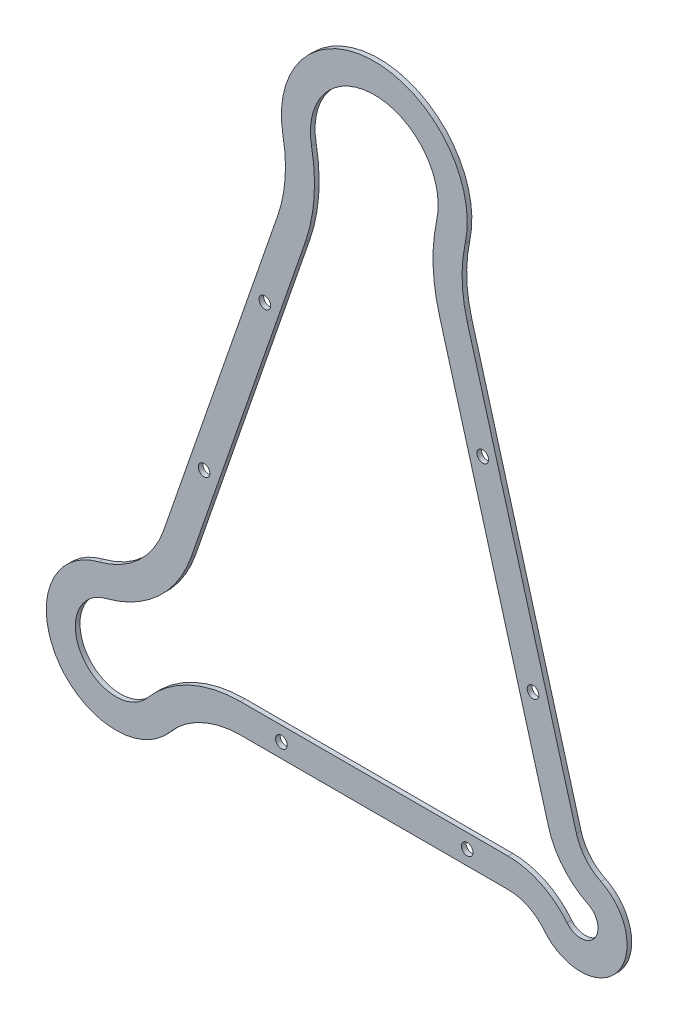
ISO-10303-21;
HEADER;
FILE_DESCRIPTION(('STEP AP214'),'2;1');
FILE_NAME('part.step','',(''),(''),'','','');
FILE_SCHEMA(('AUTOMOTIVE_DESIGN { 1 0 10303 214 1 1 1 1 }'));
ENDSEC;
DATA;
#1=APPLICATION_CONTEXT('core data for automotive mechanical design processes');
#2=APPLICATION_PROTOCOL_DEFINITION('international standard','automotive_design',2000,#1);
#3=PRODUCT_CONTEXT('',#1,'mechanical');
#4=PRODUCT('Part','Part','',(#3));
#5=PRODUCT_RELATED_PRODUCT_CATEGORY('part','',(#4));
#6=PRODUCT_DEFINITION_FORMATION('','',#4);
#7=PRODUCT_DEFINITION_CONTEXT('part definition',#1,'design');
#8=PRODUCT_DEFINITION('design','',#6,#7);
#9=PRODUCT_DEFINITION_SHAPE('','',#8);
#10=(LENGTH_UNIT() NAMED_UNIT(*) SI_UNIT(.MILLI.,.METRE.));
#11=(NAMED_UNIT(*) PLANE_ANGLE_UNIT() SI_UNIT($,.RADIAN.));
#12=(NAMED_UNIT(*) SI_UNIT($,.STERADIAN.) SOLID_ANGLE_UNIT());
#13=UNCERTAINTY_MEASURE_WITH_UNIT(LENGTH_MEASURE(1.E-05),#10,'distance_accuracy_value','');
#14=(GEOMETRIC_REPRESENTATION_CONTEXT(3) GLOBAL_UNCERTAINTY_ASSIGNED_CONTEXT((#13)) GLOBAL_UNIT_ASSIGNED_CONTEXT((#10,
#11,#12)) REPRESENTATION_CONTEXT('',''));
#15=CARTESIAN_POINT('',(0.,0.,0.));
#16=DIRECTION('',(0.,0.,1.));
#17=DIRECTION('',(1.,0.,0.));
#18=AXIS2_PLACEMENT_3D('',#15,#16,#17);
#19=CARTESIAN_POINT('',(73.1240495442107,-133.363811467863,2.54));
#20=DIRECTION('',(0.,0.,-1.));
#21=DIRECTION('',(-1.,0.,0.));
#22=AXIS2_PLACEMENT_3D('',#19,#20,#21);
#23=CYLINDRICAL_SURFACE('',#22,25.4);
#24=CARTESIAN_POINT('',(73.1240495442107,-133.363811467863,0.));
#25=DIRECTION('',(0.,0.,1.));
#26=DIRECTION('',(1.,0.,0.));
#27=AXIS2_PLACEMENT_3D('',#24,#25,#26);
#28=CIRCLE('',#27,25.4);
#29=CARTESIAN_POINT('',(73.1240495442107,-107.963811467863,0.));
#30=VERTEX_POINT('',#29);
#31=CARTESIAN_POINT('',(92.9519181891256,-117.488811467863,0.));
#32=VERTEX_POINT('',#31);
#33=EDGE_CURVE('E251',#30,#32,#28,.F.);
#34=ORIENTED_EDGE('',*,*,#33,.T.);
#35=DIRECTION('',(0.,0.,-1.));
#36=VECTOR('',#35,1.);
#37=CARTESIAN_POINT('',(92.9519181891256,-117.488811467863,2.54));
#38=LINE('',#37,#36);
#39=CARTESIAN_POINT('',(92.9519181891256,-117.488811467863,2.54));
#40=VERTEX_POINT('',#39);
#41=EDGE_CURVE('E11',#40,#32,#38,.T.);
#42=ORIENTED_EDGE('',*,*,#41,.F.);
#43=CARTESIAN_POINT('',(73.1240495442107,-133.363811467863,2.54));
#44=DIRECTION('',(0.,0.,1.));
#45=DIRECTION('',(1.,0.,0.));
#46=AXIS2_PLACEMENT_3D('',#43,#44,#45);
#47=CIRCLE('',#46,25.4);
#48=CARTESIAN_POINT('',(73.1240495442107,-107.963811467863,2.54));
#49=VERTEX_POINT('',#48);
#50=EDGE_CURVE('E327',#49,#40,#47,.F.);
#51=ORIENTED_EDGE('',*,*,#50,.F.);
#52=DIRECTION('',(0.,0.,-1.));
#53=VECTOR('',#52,1.);
#54=CARTESIAN_POINT('',(73.1240495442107,-107.963811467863,2.54));
#55=LINE('',#54,#53);
#56=EDGE_CURVE('E206',#49,#30,#55,.T.);
#57=ORIENTED_EDGE('',*,*,#56,.T.);
#58=EDGE_LOOP('',(#34,#42,#51,#57));
#59=FACE_BOUND('',#58,.T.);
#60=ADVANCED_FACE('F33',(#59),#23,.F.);
#61=CARTESIAN_POINT('',(112.77978683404,-101.613811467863,2.54));
#62=DIRECTION('',(0.,0.,-1.));
#63=DIRECTION('',(-1.,0.,0.));
#64=AXIS2_PLACEMENT_3D('',#61,#62,#63);
#65=CYLINDRICAL_SURFACE('',#64,25.4);
#66=CARTESIAN_POINT('',(112.77978683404,-101.613811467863,0.));
#67=DIRECTION('',(0.,0.,1.));
#68=DIRECTION('',(1.,0.,0.));
#69=AXIS2_PLACEMENT_3D('',#66,#67,#68);
#70=CIRCLE('',#69,25.4);
#71=CARTESIAN_POINT('',(123.873001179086,-78.7642907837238,0.));
#72=VERTEX_POINT('',#71);
#73=EDGE_CURVE('E254',#32,#72,#70,.T.);
#74=ORIENTED_EDGE('',*,*,#73,.T.);
#75=DIRECTION('',(0.,0.,-1.));
#76=VECTOR('',#75,1.);
#77=CARTESIAN_POINT('',(123.873001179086,-78.7642907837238,2.54));
#78=LINE('',#77,#76);
#79=CARTESIAN_POINT('',(123.873001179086,-78.7642907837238,2.54));
#80=VERTEX_POINT('',#79);
#81=EDGE_CURVE('E42',#80,#72,#78,.T.);
#82=ORIENTED_EDGE('',*,*,#81,.F.);
#83=CARTESIAN_POINT('',(112.77978683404,-101.613811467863,2.54));
#84=DIRECTION('',(0.,0.,1.));
#85=DIRECTION('',(1.,0.,0.));
#86=AXIS2_PLACEMENT_3D('',#83,#84,#85);
#87=CIRCLE('',#86,25.4);
#88=EDGE_CURVE('E329',#40,#80,#87,.T.);
#89=ORIENTED_EDGE('',*,*,#88,.F.);
#90=ORIENTED_EDGE('',*,*,#41,.T.);
#91=EDGE_LOOP('',(#74,#82,#89,#90));
#92=FACE_BOUND('',#91,.T.);
#93=ADVANCED_FACE('F447',(#92),#65,.T.);
#94=CARTESIAN_POINT('',(134.966215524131,-55.9147700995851,2.54));
#95=DIRECTION('',(0.,0.,-1.));
#96=DIRECTION('',(-1.,0.,0.));
#97=AXIS2_PLACEMENT_3D('',#94,#95,#96);
#98=CYLINDRICAL_SURFACE('',#97,25.4);
#99=CARTESIAN_POINT('',(134.966215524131,-55.9147700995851,0.));
#100=DIRECTION('',(0.,0.,1.));
#101=DIRECTION('',(1.,0.,0.));
#102=AXIS2_PLACEMENT_3D('',#99,#100,#101);
#103=CIRCLE('',#102,25.4);
#104=CARTESIAN_POINT('',(110.513625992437,-62.787241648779,0.));
#105=VERTEX_POINT('',#104);
#106=EDGE_CURVE('E256',#72,#105,#103,.F.);
#107=ORIENTED_EDGE('',*,*,#106,.T.);
#108=DIRECTION('',(0.,0.,-1.));
#109=VECTOR('',#108,1.);
#110=CARTESIAN_POINT('',(110.513625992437,-62.787241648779,2.54));
#111=LINE('',#110,#109);
#112=CARTESIAN_POINT('',(110.513625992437,-62.787241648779,2.54));
#113=VERTEX_POINT('',#112);
#114=EDGE_CURVE('E375',#113,#105,#111,.T.);
#115=ORIENTED_EDGE('',*,*,#114,.F.);
#116=CARTESIAN_POINT('',(134.966215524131,-55.9147700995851,2.54));
#117=DIRECTION('',(0.,0.,1.));
#118=DIRECTION('',(1.,0.,0.));
#119=AXIS2_PLACEMENT_3D('',#116,#117,#118);
#120=CIRCLE('',#119,25.4);
#121=EDGE_CURVE('E331',#80,#113,#120,.F.);
#122=ORIENTED_EDGE('',*,*,#121,.F.);
#123=ORIENTED_EDGE('',*,*,#81,.T.);
#124=EDGE_LOOP('',(#107,#115,#122,#123));
#125=FACE_BOUND('',#124,.T.);
#126=ADVANCED_FACE('F453',(#125),#98,.F.);
#127=CARTESIAN_POINT('',(173.683771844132,-287.549706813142,2.54));
#128=DIRECTION('',(-0.962700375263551,-0.270569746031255,0.));
#129=DIRECTION('',(0.270569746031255,-0.962700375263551,0.));
#130=AXIS2_PLACEMENT_3D('',#127,#128,#129);
#131=PLANE('',#130);
#132=DIRECTION('',(-0.270569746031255,0.962700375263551,0.));
#133=VECTOR('',#132,1.);
#134=CARTESIAN_POINT('',(173.683771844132,-287.549706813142,0.));
#135=LINE('',#134,#133);
#136=CARTESIAN_POINT('',(50.8180578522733,149.612506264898,0.));
#137=VERTEX_POINT('',#136);
#138=EDGE_CURVE('E258',#105,#137,#135,.T.);
#139=ORIENTED_EDGE('',*,*,#138,.T.);
#140=DIRECTION('',(0.,0.,-1.));
#141=VECTOR('',#140,1.);
#142=CARTESIAN_POINT('',(50.8180578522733,149.612506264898,2.54));
#143=LINE('',#142,#141);
#144=CARTESIAN_POINT('',(50.8180578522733,149.612506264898,2.54));
#145=VERTEX_POINT('',#144);
#146=EDGE_CURVE('E372',#145,#137,#143,.T.);
#147=ORIENTED_EDGE('',*,*,#146,.F.);
#148=DIRECTION('',(-0.270569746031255,0.962700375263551,0.));
#149=VECTOR('',#148,1.);
#150=CARTESIAN_POINT('',(173.683771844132,-287.549706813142,2.54));
#151=LINE('',#150,#149);
#152=EDGE_CURVE('E333',#113,#145,#151,.T.);
#153=ORIENTED_EDGE('',*,*,#152,.F.);
#154=ORIENTED_EDGE('',*,*,#114,.T.);
#155=EDGE_LOOP('',(#139,#147,#153,#154));
#156=FACE_BOUND('',#155,.T.);
#157=ADVANCED_FACE('F704',(#156),#131,.F.);
#158=CARTESIAN_POINT('',(124.175826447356,170.229920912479,2.54));
#159=DIRECTION('',(0.,0.,-1.));
#160=DIRECTION('',(-1.,0.,0.));
#161=AXIS2_PLACEMENT_3D('',#158,#159,#160);
#162=CYLINDRICAL_SURFACE('',#161,76.2);
#163=CARTESIAN_POINT('',(124.175826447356,170.229920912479,0.));
#164=DIRECTION('',(0.,0.,1.));
#165=DIRECTION('',(1.,0.,0.));
#166=AXIS2_PLACEMENT_3D('',#163,#164,#165);
#167=CIRCLE('',#166,76.2);
#168=CARTESIAN_POINT('',(49.6703305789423,186.210255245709,0.));
#169=VERTEX_POINT('',#168);
#170=EDGE_CURVE('E260',#137,#169,#167,.F.);
#171=ORIENTED_EDGE('',*,*,#170,.T.);
#172=DIRECTION('',(0.,0.,-1.));
#173=VECTOR('',#172,1.);
#174=CARTESIAN_POINT('',(49.6703305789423,186.210255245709,2.54));
#175=LINE('',#174,#173);
#176=CARTESIAN_POINT('',(49.6703305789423,186.210255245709,2.54));
#177=VERTEX_POINT('',#176);
#178=EDGE_CURVE('E369',#177,#169,#175,.T.);
#179=ORIENTED_EDGE('',*,*,#178,.F.);
#180=CARTESIAN_POINT('',(124.175826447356,170.229920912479,2.54));
#181=DIRECTION('',(0.,0.,1.));
#182=DIRECTION('',(1.,0.,0.));
#183=AXIS2_PLACEMENT_3D('',#180,#181,#182);
#184=CIRCLE('',#183,76.2);
#185=EDGE_CURVE('E335',#145,#177,#184,.F.);
#186=ORIENTED_EDGE('',*,*,#185,.F.);
#187=ORIENTED_EDGE('',*,*,#146,.T.);
#188=EDGE_LOOP('',(#171,#179,#186,#187));
#189=FACE_BOUND('',#188,.T.);
#190=ADVANCED_FACE('F693',(#189),#162,.F.);
#191=CARTESIAN_POINT('',(0.,196.863811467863,2.54));
#192=DIRECTION('',(0.,0.,-1.));
#193=DIRECTION('',(-1.,0.,0.));
#194=AXIS2_PLACEMENT_3D('',#191,#192,#193);
#195=CYLINDRICAL_SURFACE('',#194,50.8);
#196=CARTESIAN_POINT('',(0.,196.863811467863,0.));
#197=DIRECTION('',(0.,0.,1.));
#198=DIRECTION('',(1.,0.,0.));
#199=AXIS2_PLACEMENT_3D('',#196,#197,#198);
#200=CIRCLE('',#199,50.8);
#201=CARTESIAN_POINT('',(-49.9084233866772,187.388091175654,0.));
#202=VERTEX_POINT('',#201);
#203=EDGE_CURVE('E262',#169,#202,#200,.T.);
#204=ORIENTED_EDGE('',*,*,#203,.T.);
#205=DIRECTION('',(0.,0.,-1.));
#206=VECTOR('',#205,1.);
#207=CARTESIAN_POINT('',(-49.9084233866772,187.388091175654,2.54));
#208=LINE('',#207,#206);
#209=CARTESIAN_POINT('',(-49.9084233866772,187.388091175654,2.54));
#210=VERTEX_POINT('',#209);
#211=EDGE_CURVE('E366',#210,#202,#208,.T.);
#212=ORIENTED_EDGE('',*,*,#211,.F.);
#213=CARTESIAN_POINT('',(0.,196.863811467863,2.54));
#214=DIRECTION('',(0.,0.,1.));
#215=DIRECTION('',(1.,0.,0.));
#216=AXIS2_PLACEMENT_3D('',#213,#214,#215);
#217=CIRCLE('',#216,50.8);
#218=EDGE_CURVE('E337',#177,#210,#217,.T.);
#219=ORIENTED_EDGE('',*,*,#218,.F.);
#220=ORIENTED_EDGE('',*,*,#178,.T.);
#221=EDGE_LOOP('',(#204,#212,#219,#220));
#222=FACE_BOUND('',#221,.T.);
#223=ADVANCED_FACE('F682',(#222),#195,.T.);
#224=CARTESIAN_POINT('',(-124.771058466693,173.174510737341,2.54));
#225=DIRECTION('',(0.,0.,-1.));
#226=DIRECTION('',(-1.,0.,0.));
#227=AXIS2_PLACEMENT_3D('',#224,#225,#226);
#228=CYLINDRICAL_SURFACE('',#227,76.2);
#229=CARTESIAN_POINT('',(-124.771058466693,173.174510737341,0.));
#230=DIRECTION('',(0.,0.,1.));
#231=DIRECTION('',(1.,0.,0.));
#232=AXIS2_PLACEMENT_3D('',#229,#230,#231);
#233=CIRCLE('',#232,76.2);
#234=CARTESIAN_POINT('',(-52.7611943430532,148.254248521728,0.));
#235=VERTEX_POINT('',#234);
#236=EDGE_CURVE('E264',#202,#235,#233,.F.);
#237=ORIENTED_EDGE('',*,*,#236,.T.);
#238=DIRECTION('',(0.,0.,-1.));
#239=VECTOR('',#238,1.);
#240=CARTESIAN_POINT('',(-52.7611943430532,148.254248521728,2.54));
#241=LINE('',#240,#239);
#242=CARTESIAN_POINT('',(-52.7611943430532,148.254248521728,2.54));
#243=VERTEX_POINT('',#242);
#244=EDGE_CURVE('E363',#243,#235,#241,.T.);
#245=ORIENTED_EDGE('',*,*,#244,.F.);
#246=CARTESIAN_POINT('',(-124.771058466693,173.174510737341,2.54));
#247=DIRECTION('',(0.,0.,1.));
#248=DIRECTION('',(1.,0.,0.));
#249=AXIS2_PLACEMENT_3D('',#246,#247,#248);
#250=CIRCLE('',#249,76.2);
#251=EDGE_CURVE('E339',#210,#243,#250,.F.);
#252=ORIENTED_EDGE('',*,*,#251,.F.);
#253=ORIENTED_EDGE('',*,*,#211,.T.);
#254=EDGE_LOOP('',(#237,#245,#252,#253));
#255=FACE_BOUND('',#254,.T.);
#256=ADVANCED_FACE('F671',(#255),#228,.F.);
#257=CARTESIAN_POINT('',(-199.671462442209,-276.259279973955,2.54));
#258=DIRECTION('',(0.945011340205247,-0.32703756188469,0.));
#259=DIRECTION('',(0.32703756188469,0.945011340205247,0.));
#260=AXIS2_PLACEMENT_3D('',#257,#258,#259);
#261=PLANE('',#260);
#262=DIRECTION('',(-0.32703756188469,-0.945011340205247,0.));
#263=VECTOR('',#262,1.);
#264=CARTESIAN_POINT('',(-199.671462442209,-276.259279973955,0.));
#265=LINE('',#264,#263);
#266=CARTESIAN_POINT('',(-115.169402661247,-32.0811974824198,0.));
#267=VERTEX_POINT('',#266);
#268=EDGE_CURVE('E266',#235,#267,#265,.T.);
#269=ORIENTED_EDGE('',*,*,#268,.T.);
#270=DIRECTION('',(0.,0.,-1.));
#271=VECTOR('',#270,1.);
#272=CARTESIAN_POINT('',(-115.169402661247,-32.0811974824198,2.54));
#273=LINE('',#272,#271);
#274=CARTESIAN_POINT('',(-115.169402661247,-32.0811974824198,2.54));
#275=VERTEX_POINT('',#274);
#276=EDGE_CURVE('E360',#275,#267,#273,.T.);
#277=ORIENTED_EDGE('',*,*,#276,.F.);
#278=DIRECTION('',(-0.32703756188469,-0.945011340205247,0.));
#279=VECTOR('',#278,1.);
#280=CARTESIAN_POINT('',(-199.671462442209,-276.259279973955,2.54));
#281=LINE('',#280,#279);
#282=EDGE_CURVE('E341',#243,#275,#281,.T.);
#283=ORIENTED_EDGE('',*,*,#282,.F.);
#284=ORIENTED_EDGE('',*,*,#244,.T.);
#285=EDGE_LOOP('',(#269,#277,#283,#284));
#286=FACE_BOUND('',#285,.T.);
#287=ADVANCED_FACE('F660',(#286),#261,.F.);
#288=CARTESIAN_POINT('',(-163.175978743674,-15.4676893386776,2.54));
#289=DIRECTION('',(0.,0.,-1.));
#290=DIRECTION('',(-1.,0.,0.));
#291=AXIS2_PLACEMENT_3D('',#288,#289,#290);
#292=CYLINDRICAL_SURFACE('',#291,50.8);
#293=CARTESIAN_POINT('',(-163.175978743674,-15.4676893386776,0.));
#294=DIRECTION('',(0.,0.,1.));
#295=DIRECTION('',(1.,0.,0.));
#296=AXIS2_PLACEMENT_3D('',#293,#294,#295);
#297=CIRCLE('',#296,50.8);
#298=CARTESIAN_POINT('',(-150.62982698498,-64.694044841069,0.));
#299=VERTEX_POINT('',#298);
#300=EDGE_CURVE('E268',#267,#299,#297,.F.);
#301=ORIENTED_EDGE('',*,*,#300,.T.);
#302=DIRECTION('',(0.,0.,-1.));
#303=VECTOR('',#302,1.);
#304=CARTESIAN_POINT('',(-150.62982698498,-64.694044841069,2.54));
#305=LINE('',#304,#303);
#306=CARTESIAN_POINT('',(-150.62982698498,-64.694044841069,2.54));
#307=VERTEX_POINT('',#306);
#308=EDGE_CURVE('E357',#307,#299,#305,.T.);
#309=ORIENTED_EDGE('',*,*,#308,.F.);
#310=CARTESIAN_POINT('',(-163.175978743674,-15.4676893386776,2.54));
#311=DIRECTION('',(0.,0.,1.));
#312=DIRECTION('',(1.,0.,0.));
#313=AXIS2_PLACEMENT_3D('',#310,#311,#312);
#314=CIRCLE('',#313,50.8);
#315=EDGE_CURVE('E343',#275,#307,#314,.F.);
#316=ORIENTED_EDGE('',*,*,#315,.F.);
#317=ORIENTED_EDGE('',*,*,#276,.T.);
#318=EDGE_LOOP('',(#301,#309,#316,#317));
#319=FACE_BOUND('',#318,.T.);
#320=ADVANCED_FACE('F649',(#319),#292,.F.);
#321=CARTESIAN_POINT('',(-141.22021316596,-101.613811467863,2.54));
#322=DIRECTION('',(0.,0.,-1.));
#323=DIRECTION('',(-1.,0.,0.));
#324=AXIS2_PLACEMENT_3D('',#321,#322,#323);
#325=CYLINDRICAL_SURFACE('',#324,38.1);
#326=CARTESIAN_POINT('',(-141.22021316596,-101.613811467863,0.));
#327=DIRECTION('',(0.,0.,1.));
#328=DIRECTION('',(1.,0.,0.));
#329=AXIS2_PLACEMENT_3D('',#326,#327,#328);
#330=CIRCLE('',#329,38.1);
#331=CARTESIAN_POINT('',(-112.036143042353,-126.10666861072,0.));
#332=VERTEX_POINT('',#331);
#333=EDGE_CURVE('E270',#299,#332,#330,.T.);
#334=ORIENTED_EDGE('',*,*,#333,.T.);
#335=DIRECTION('',(0.,0.,-1.));
#336=VECTOR('',#335,1.);
#337=CARTESIAN_POINT('',(-112.036143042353,-126.10666861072,2.54));
#338=LINE('',#337,#336);
#339=CARTESIAN_POINT('',(-112.036143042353,-126.10666861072,2.54));
#340=VERTEX_POINT('',#339);
#341=EDGE_CURVE('E354',#340,#332,#338,.T.);
#342=ORIENTED_EDGE('',*,*,#341,.F.);
#343=CARTESIAN_POINT('',(-141.22021316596,-101.613811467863,2.54));
#344=DIRECTION('',(0.,0.,1.));
#345=DIRECTION('',(1.,0.,0.));
#346=AXIS2_PLACEMENT_3D('',#343,#344,#345);
#347=CIRCLE('',#346,38.1);
#348=EDGE_CURVE('E345',#307,#340,#347,.T.);
#349=ORIENTED_EDGE('',*,*,#348,.F.);
#350=ORIENTED_EDGE('',*,*,#308,.T.);
#351=EDGE_LOOP('',(#334,#342,#349,#350));
#352=FACE_BOUND('',#351,.T.);
#353=ADVANCED_FACE('F637',(#352),#325,.T.);
#354=CARTESIAN_POINT('',(-73.1240495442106,-158.763811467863,2.54));
#355=DIRECTION('',(0.,0.,-1.));
#356=DIRECTION('',(-1.,0.,0.));
#357=AXIS2_PLACEMENT_3D('',#354,#355,#356);
#358=CYLINDRICAL_SURFACE('',#357,50.8);
#359=CARTESIAN_POINT('',(-73.1240495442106,-158.763811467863,0.));
#360=DIRECTION('',(0.,0.,1.));
#361=DIRECTION('',(1.,0.,0.));
#362=AXIS2_PLACEMENT_3D('',#359,#360,#361);
#363=CIRCLE('',#362,50.8);
#364=CARTESIAN_POINT('',(-73.1240495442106,-107.963811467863,0.));
#365=VERTEX_POINT('',#364);
#366=EDGE_CURVE('E272',#332,#365,#363,.F.);
#367=ORIENTED_EDGE('',*,*,#366,.T.);
#368=DIRECTION('',(0.,0.,-1.));
#369=VECTOR('',#368,1.);
#370=CARTESIAN_POINT('',(-73.1240495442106,-107.963811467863,2.54));
#371=LINE('',#370,#369);
#372=CARTESIAN_POINT('',(-73.1240495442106,-107.963811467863,2.54));
#373=VERTEX_POINT('',#372);
#374=EDGE_CURVE('E351',#373,#365,#371,.T.);
#375=ORIENTED_EDGE('',*,*,#374,.F.);
#376=CARTESIAN_POINT('',(-73.1240495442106,-158.763811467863,2.54));
#377=DIRECTION('',(0.,0.,1.));
#378=DIRECTION('',(1.,0.,0.));
#379=AXIS2_PLACEMENT_3D('',#376,#377,#378);
#380=CIRCLE('',#379,50.8);
#381=EDGE_CURVE('E55',#340,#373,#380,.F.);
#382=ORIENTED_EDGE('',*,*,#381,.F.);
#383=ORIENTED_EDGE('',*,*,#341,.T.);
#384=EDGE_LOOP('',(#367,#375,#382,#383));
#385=FACE_BOUND('',#384,.T.);
#386=ADVANCED_FACE('F629',(#385),#358,.F.);
#387=CARTESIAN_POINT('',(134.966215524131,-55.9147700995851,2.54));
#388=DIRECTION('',(0.,0.,-1.));
#389=DIRECTION('',(-1.,0.,0.));
#390=AXIS2_PLACEMENT_3D('',#387,#388,#389);
#391=CYLINDRICAL_SURFACE('',#390,41.275);
#392=CARTESIAN_POINT('',(134.966215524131,-55.9147700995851,0.));
#393=DIRECTION('',(0.,0.,1.));
#394=DIRECTION('',(1.,0.,0.));
#395=AXIS2_PLACEMENT_3D('',#392,#393,#394);
#396=CIRCLE('',#395,41.275);
#397=CARTESIAN_POINT('',(116.939742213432,-93.0452412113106,0.));
#398=VERTEX_POINT('',#397);
#399=CARTESIAN_POINT('',(95.2307575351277,-67.0825363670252,0.));
#400=VERTEX_POINT('',#399);
#401=EDGE_CURVE('E209',#398,#400,#396,.F.);
#402=ORIENTED_EDGE('',*,*,#401,.F.);
#403=DIRECTION('',(0.,0.,-1.));
#404=VECTOR('',#403,1.);
#405=CARTESIAN_POINT('',(116.939742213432,-93.0452412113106,2.54));
#406=LINE('',#405,#404);
#407=CARTESIAN_POINT('',(116.939742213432,-93.0452412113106,2.54));
#408=VERTEX_POINT('',#407);
#409=EDGE_CURVE('E37',#408,#398,#406,.T.);
#410=ORIENTED_EDGE('',*,*,#409,.F.);
#411=CARTESIAN_POINT('',(134.966215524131,-55.9147700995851,2.54));
#412=DIRECTION('',(0.,0.,1.));
#413=DIRECTION('',(1.,0.,0.));
#414=AXIS2_PLACEMENT_3D('',#411,#412,#413);
#415=CIRCLE('',#414,41.275);
#416=CARTESIAN_POINT('',(95.2307575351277,-67.0825363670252,2.54));
#417=VERTEX_POINT('',#416);
#418=EDGE_CURVE('E294',#408,#417,#415,.F.);
#419=ORIENTED_EDGE('',*,*,#418,.T.);
#420=DIRECTION('',(0.,0.,-1.));
#421=VECTOR('',#420,1.);
#422=CARTESIAN_POINT('',(95.2307575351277,-67.0825363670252,2.54));
#423=LINE('',#422,#421);
#424=EDGE_CURVE('E211',#417,#400,#423,.T.);
#425=ORIENTED_EDGE('',*,*,#424,.T.);
#426=EDGE_LOOP('',(#402,#410,#419,#425));
#427=FACE_BOUND('',#426,.T.);
#428=ADVANCED_FACE('F210',(#427),#391,.T.);
#429=CARTESIAN_POINT('',(112.77978683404,-101.613811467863,2.54));
#430=DIRECTION('',(0.,0.,-1.));
#431=DIRECTION('',(-1.,0.,0.));
#432=AXIS2_PLACEMENT_3D('',#429,#430,#431);
#433=CYLINDRICAL_SURFACE('',#432,9.52500000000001);
#434=CARTESIAN_POINT('',(112.77978683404,-101.613811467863,0.));
#435=DIRECTION('',(0.,0.,1.));
#436=DIRECTION('',(1.,0.,0.));
#437=AXIS2_PLACEMENT_3D('',#434,#435,#436);
#438=CIRCLE('',#437,9.52500000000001);
#439=CARTESIAN_POINT('',(105.344336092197,-107.566936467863,0.));
#440=VERTEX_POINT('',#439);
#441=EDGE_CURVE('E199',#440,#398,#438,.T.);
#442=ORIENTED_EDGE('',*,*,#441,.F.);
#443=DIRECTION('',(0.,0.,-1.));
#444=VECTOR('',#443,1.);
#445=CARTESIAN_POINT('',(105.344336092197,-107.566936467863,2.54));
#446=LINE('',#445,#444);
#447=CARTESIAN_POINT('',(105.344336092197,-107.566936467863,2.54));
#448=VERTEX_POINT('',#447);
#449=EDGE_CURVE('E207',#448,#440,#446,.T.);
#450=ORIENTED_EDGE('',*,*,#449,.F.);
#451=CARTESIAN_POINT('',(112.77978683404,-101.613811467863,2.54));
#452=DIRECTION('',(0.,0.,1.));
#453=DIRECTION('',(1.,0.,0.));
#454=AXIS2_PLACEMENT_3D('',#451,#452,#453);
#455=CIRCLE('',#454,9.52500000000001);
#456=EDGE_CURVE('E202',#448,#408,#455,.T.);
#457=ORIENTED_EDGE('',*,*,#456,.T.);
#458=ORIENTED_EDGE('',*,*,#409,.T.);
#459=EDGE_LOOP('',(#442,#450,#457,#458));
#460=FACE_BOUND('',#459,.T.);
#461=ADVANCED_FACE('F197',(#460),#433,.F.);
#462=CARTESIAN_POINT('',(73.1240495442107,-133.363811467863,2.54));
#463=DIRECTION('',(0.,0.,-1.));
#464=DIRECTION('',(-1.,0.,0.));
#465=AXIS2_PLACEMENT_3D('',#462,#463,#464);
#466=CYLINDRICAL_SURFACE('',#465,41.275);
#467=CARTESIAN_POINT('',(73.1240495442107,-133.363811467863,0.));
#468=DIRECTION('',(0.,0.,1.));
#469=DIRECTION('',(1.,0.,0.));
#470=AXIS2_PLACEMENT_3D('',#467,#468,#469);
#471=CIRCLE('',#470,41.275);
#472=CARTESIAN_POINT('',(73.1240495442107,-92.0888114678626,0.));
#473=VERTEX_POINT('',#472);
#474=EDGE_CURVE('E221',#473,#440,#471,.F.);
#475=ORIENTED_EDGE('',*,*,#474,.F.);
#476=DIRECTION('',(0.,0.,-1.));
#477=VECTOR('',#476,1.);
#478=CARTESIAN_POINT('',(73.1240495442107,-92.0888114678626,2.54));
#479=LINE('',#478,#477);
#480=CARTESIAN_POINT('',(73.1240495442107,-92.0888114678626,2.54));
#481=VERTEX_POINT('',#480);
#482=EDGE_CURVE('E397',#481,#473,#479,.T.);
#483=ORIENTED_EDGE('',*,*,#482,.F.);
#484=CARTESIAN_POINT('',(73.1240495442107,-133.363811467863,2.54));
#485=DIRECTION('',(0.,0.,1.));
#486=DIRECTION('',(1.,0.,0.));
#487=AXIS2_PLACEMENT_3D('',#484,#485,#486);
#488=CIRCLE('',#487,41.275);
#489=EDGE_CURVE('E297',#481,#448,#488,.F.);
#490=ORIENTED_EDGE('',*,*,#489,.T.);
#491=ORIENTED_EDGE('',*,*,#449,.T.);
#492=EDGE_LOOP('',(#475,#483,#490,#491));
#493=FACE_BOUND('',#492,.T.);
#494=ADVANCED_FACE('F399',(#493),#466,.T.);
#495=CARTESIAN_POINT('',(-14.3433655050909,-92.0888114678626,2.54));
#496=DIRECTION('',(0.,1.,0.));
#497=DIRECTION('',(-1.,0.,0.));
#498=AXIS2_PLACEMENT_3D('',#495,#496,#497);
#499=PLANE('',#498);
#500=DIRECTION('',(1.,0.,0.));
#501=VECTOR('',#500,1.);
#502=CARTESIAN_POINT('',(-14.3433655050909,-92.0888114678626,0.));
#503=LINE('',#502,#501);
#504=CARTESIAN_POINT('',(-73.1240495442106,-92.0888114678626,0.));
#505=VERTEX_POINT('',#504);
#506=EDGE_CURVE('E223',#505,#473,#503,.T.);
#507=ORIENTED_EDGE('',*,*,#506,.F.);
#508=DIRECTION('',(0.,0.,-1.));
#509=VECTOR('',#508,1.);
#510=CARTESIAN_POINT('',(-73.1240495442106,-92.0888114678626,2.54));
#511=LINE('',#510,#509);
#512=CARTESIAN_POINT('',(-73.1240495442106,-92.0888114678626,2.54));
#513=VERTEX_POINT('',#512);
#514=EDGE_CURVE('E395',#513,#505,#511,.T.);
#515=ORIENTED_EDGE('',*,*,#514,.F.);
#516=DIRECTION('',(1.,0.,0.));
#517=VECTOR('',#516,1.);
#518=CARTESIAN_POINT('',(-14.3433655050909,-92.0888114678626,2.54));
#519=LINE('',#518,#517);
#520=EDGE_CURVE('E300',#513,#481,#519,.T.);
#521=ORIENTED_EDGE('',*,*,#520,.T.);
#522=ORIENTED_EDGE('',*,*,#482,.T.);
#523=EDGE_LOOP('',(#507,#515,#521,#522));
#524=FACE_BOUND('',#523,.T.);
#525=ADVANCED_FACE('F437',(#524),#499,.T.);
#526=CARTESIAN_POINT('',(-73.1240495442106,-158.763811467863,2.54));
#527=DIRECTION('',(0.,0.,-1.));
#528=DIRECTION('',(-1.,0.,0.));
#529=AXIS2_PLACEMENT_3D('',#526,#527,#528);
#530=CYLINDRICAL_SURFACE('',#529,66.675);
#531=CARTESIAN_POINT('',(-73.1240495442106,-158.763811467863,0.));
#532=DIRECTION('',(0.,0.,1.));
#533=DIRECTION('',(1.,0.,0.));
#534=AXIS2_PLACEMENT_3D('',#531,#532,#533);
#535=CIRCLE('',#534,66.675);
#536=CARTESIAN_POINT('',(-124.196172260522,-115.901311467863,0.));
#537=VERTEX_POINT('',#536);
#538=EDGE_CURVE('E228',#537,#505,#535,.F.);
#539=ORIENTED_EDGE('',*,*,#538,.F.);
#540=DIRECTION('',(0.,0.,-1.));
#541=VECTOR('',#540,1.);
#542=CARTESIAN_POINT('',(-124.196172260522,-115.901311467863,2.54));
#543=LINE('',#542,#541);
#544=CARTESIAN_POINT('',(-124.196172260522,-115.901311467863,2.54));
#545=VERTEX_POINT('',#544);
#546=EDGE_CURVE('E393',#545,#537,#543,.T.);
#547=ORIENTED_EDGE('',*,*,#546,.F.);
#548=CARTESIAN_POINT('',(-73.1240495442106,-158.763811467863,2.54));
#549=DIRECTION('',(0.,0.,1.));
#550=DIRECTION('',(1.,0.,0.));
#551=AXIS2_PLACEMENT_3D('',#548,#549,#550);
#552=CIRCLE('',#551,66.675);
#553=EDGE_CURVE('E303',#545,#513,#552,.F.);
#554=ORIENTED_EDGE('',*,*,#553,.T.);
#555=ORIENTED_EDGE('',*,*,#514,.T.);
#556=EDGE_LOOP('',(#539,#547,#554,#555));
#557=FACE_BOUND('',#556,.T.);
#558=ADVANCED_FACE('F434',(#557),#530,.T.);
#559=CARTESIAN_POINT('',(-141.22021316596,-101.613811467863,2.54));
#560=DIRECTION('',(0.,0.,-1.));
#561=DIRECTION('',(-1.,0.,0.));
#562=AXIS2_PLACEMENT_3D('',#559,#560,#561);
#563=CYLINDRICAL_SURFACE('',#562,22.225);
#564=CARTESIAN_POINT('',(-141.22021316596,-101.613811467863,0.));
#565=DIRECTION('',(0.,0.,1.));
#566=DIRECTION('',(1.,0.,0.));
#567=AXIS2_PLACEMENT_3D('',#564,#565,#566);
#568=CIRCLE('',#567,22.225);
#569=CARTESIAN_POINT('',(-146.709154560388,-80.0772809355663,0.));
#570=VERTEX_POINT('',#569);
#571=EDGE_CURVE('E231',#570,#537,#568,.T.);
#572=ORIENTED_EDGE('',*,*,#571,.F.);
#573=DIRECTION('',(0.,0.,-1.));
#574=VECTOR('',#573,1.);
#575=CARTESIAN_POINT('',(-146.709154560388,-80.0772809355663,2.54));
#576=LINE('',#575,#574);
#577=CARTESIAN_POINT('',(-146.709154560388,-80.0772809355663,2.54));
#578=VERTEX_POINT('',#577);
#579=EDGE_CURVE('E391',#578,#570,#576,.T.);
#580=ORIENTED_EDGE('',*,*,#579,.F.);
#581=CARTESIAN_POINT('',(-141.22021316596,-101.613811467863,2.54));
#582=DIRECTION('',(0.,0.,1.));
#583=DIRECTION('',(1.,0.,0.));
#584=AXIS2_PLACEMENT_3D('',#581,#582,#583);
#585=CIRCLE('',#584,22.225);
#586=EDGE_CURVE('E306',#578,#545,#585,.T.);
#587=ORIENTED_EDGE('',*,*,#586,.T.);
#588=ORIENTED_EDGE('',*,*,#546,.T.);
#589=EDGE_LOOP('',(#572,#580,#587,#588));
#590=FACE_BOUND('',#589,.T.);
#591=ADVANCED_FACE('F430',(#590),#563,.F.);
#592=CARTESIAN_POINT('',(-163.175978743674,-15.4676893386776,2.54));
#593=DIRECTION('',(0.,0.,-1.));
#594=DIRECTION('',(-1.,0.,0.));
#595=AXIS2_PLACEMENT_3D('',#592,#593,#594);
#596=CYLINDRICAL_SURFACE('',#595,66.675);
#597=CARTESIAN_POINT('',(-163.175978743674,-15.4676893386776,0.));
#598=DIRECTION('',(0.,0.,1.));
#599=DIRECTION('',(1.,0.,0.));
#600=AXIS2_PLACEMENT_3D('',#597,#598,#599);
#601=CIRCLE('',#600,66.675);
#602=CARTESIAN_POINT('',(-100.167347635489,-37.2729187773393,0.));
#603=VERTEX_POINT('',#602);
#604=EDGE_CURVE('E234',#603,#570,#601,.F.);
#605=ORIENTED_EDGE('',*,*,#604,.F.);
#606=DIRECTION('',(0.,0.,-1.));
#607=VECTOR('',#606,1.);
#608=CARTESIAN_POINT('',(-100.167347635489,-37.2729187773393,2.54));
#609=LINE('',#608,#607);
#610=CARTESIAN_POINT('',(-100.167347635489,-37.2729187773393,2.54));
#611=VERTEX_POINT('',#610);
#612=EDGE_CURVE('E389',#611,#603,#609,.T.);
#613=ORIENTED_EDGE('',*,*,#612,.F.);
#614=CARTESIAN_POINT('',(-163.175978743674,-15.4676893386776,2.54));
#615=DIRECTION('',(0.,0.,1.));
#616=DIRECTION('',(1.,0.,0.));
#617=AXIS2_PLACEMENT_3D('',#614,#615,#616);
#618=CIRCLE('',#617,66.675);
#619=EDGE_CURVE('E309',#611,#578,#618,.F.);
#620=ORIENTED_EDGE('',*,*,#619,.T.);
#621=ORIENTED_EDGE('',*,*,#579,.T.);
#622=EDGE_LOOP('',(#605,#613,#620,#621));
#623=FACE_BOUND('',#622,.T.);
#624=ADVANCED_FACE('F426',(#623),#596,.T.);
#625=CARTESIAN_POINT('',(-184.66940741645,-281.451001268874,2.54));
#626=DIRECTION('',(0.945011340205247,-0.32703756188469,0.));
#627=DIRECTION('',(0.32703756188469,0.945011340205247,0.));
#628=AXIS2_PLACEMENT_3D('',#625,#626,#627);
#629=PLANE('',#628);
#630=DIRECTION('',(-0.32703756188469,-0.945011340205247,0.));
#631=VECTOR('',#630,1.);
#632=CARTESIAN_POINT('',(-184.66940741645,-281.451001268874,0.));
#633=LINE('',#632,#631);
#634=CARTESIAN_POINT('',(-37.7591393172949,143.062527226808,0.));
#635=VERTEX_POINT('',#634);
#636=EDGE_CURVE('E237',#635,#603,#633,.T.);
#637=ORIENTED_EDGE('',*,*,#636,.F.);
#638=DIRECTION('',(0.,0.,-1.));
#639=VECTOR('',#638,1.);
#640=CARTESIAN_POINT('',(-37.7591393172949,143.062527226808,2.54));
#641=LINE('',#640,#639);
#642=CARTESIAN_POINT('',(-37.7591393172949,143.062527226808,2.54));
#643=VERTEX_POINT('',#642);
#644=EDGE_CURVE('E387',#643,#635,#641,.T.);
#645=ORIENTED_EDGE('',*,*,#644,.F.);
#646=DIRECTION('',(-0.32703756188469,-0.945011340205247,0.));
#647=VECTOR('',#646,1.);
#648=CARTESIAN_POINT('',(-184.66940741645,-281.451001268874,2.54));
#649=LINE('',#648,#647);
#650=EDGE_CURVE('E312',#643,#611,#649,.T.);
#651=ORIENTED_EDGE('',*,*,#650,.T.);
#652=ORIENTED_EDGE('',*,*,#612,.T.);
#653=EDGE_LOOP('',(#637,#645,#651,#652));
#654=FACE_BOUND('',#653,.T.);
#655=ADVANCED_FACE('F422',(#654),#629,.T.);
#656=CARTESIAN_POINT('',(-124.771058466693,173.174510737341,2.54));
#657=DIRECTION('',(0.,0.,-1.));
#658=DIRECTION('',(-1.,0.,0.));
#659=AXIS2_PLACEMENT_3D('',#656,#657,#658);
#660=CYLINDRICAL_SURFACE('',#659,92.075);
#661=CARTESIAN_POINT('',(-124.771058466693,173.174510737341,0.));
#662=DIRECTION('',(0.,0.,1.));
#663=DIRECTION('',(1.,0.,0.));
#664=AXIS2_PLACEMENT_3D('',#661,#662,#663);
#665=CIRCLE('',#664,92.075);
#666=CARTESIAN_POINT('',(-34.3120410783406,190.349253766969,0.));
#667=VERTEX_POINT('',#666);
#668=EDGE_CURVE('E240',#667,#635,#665,.F.);
#669=ORIENTED_EDGE('',*,*,#668,.F.);
#670=DIRECTION('',(0.,0.,-1.));
#671=VECTOR('',#670,1.);
#672=CARTESIAN_POINT('',(-34.3120410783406,190.349253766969,2.54));
#673=LINE('',#672,#671);
#674=CARTESIAN_POINT('',(-34.3120410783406,190.349253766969,2.54));
#675=VERTEX_POINT('',#674);
#676=EDGE_CURVE('E385',#675,#667,#673,.T.);
#677=ORIENTED_EDGE('',*,*,#676,.F.);
#678=CARTESIAN_POINT('',(-124.771058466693,173.174510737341,2.54));
#679=DIRECTION('',(0.,0.,1.));
#680=DIRECTION('',(1.,0.,0.));
#681=AXIS2_PLACEMENT_3D('',#678,#679,#680);
#682=CIRCLE('',#681,92.075);
#683=EDGE_CURVE('E315',#675,#643,#682,.F.);
#684=ORIENTED_EDGE('',*,*,#683,.T.);
#685=ORIENTED_EDGE('',*,*,#644,.T.);
#686=EDGE_LOOP('',(#669,#677,#684,#685));
#687=FACE_BOUND('',#686,.T.);
#688=ADVANCED_FACE('F418',(#687),#660,.T.);
#689=CARTESIAN_POINT('',(0.,196.863811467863,2.54));
#690=DIRECTION('',(0.,0.,-1.));
#691=DIRECTION('',(-1.,0.,0.));
#692=AXIS2_PLACEMENT_3D('',#689,#690,#691);
#693=CYLINDRICAL_SURFACE('',#692,34.925);
#694=CARTESIAN_POINT('',(0.,196.863811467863,0.));
#695=DIRECTION('',(0.,0.,1.));
#696=DIRECTION('',(1.,0.,0.));
#697=AXIS2_PLACEMENT_3D('',#694,#695,#696);
#698=CIRCLE('',#697,34.925);
#699=CARTESIAN_POINT('',(34.1483522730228,189.539491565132,0.));
#700=VERTEX_POINT('',#699);
#701=EDGE_CURVE('E243',#700,#667,#698,.T.);
#702=ORIENTED_EDGE('',*,*,#701,.F.);
#703=DIRECTION('',(0.,0.,-1.));
#704=VECTOR('',#703,1.);
#705=CARTESIAN_POINT('',(34.1483522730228,189.539491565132,2.54));
#706=LINE('',#705,#704);
#707=CARTESIAN_POINT('',(34.1483522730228,189.539491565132,2.54));
#708=VERTEX_POINT('',#707);
#709=EDGE_CURVE('E383',#708,#700,#706,.T.);
#710=ORIENTED_EDGE('',*,*,#709,.F.);
#711=CARTESIAN_POINT('',(0.,196.863811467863,2.54));
#712=DIRECTION('',(0.,0.,1.));
#713=DIRECTION('',(1.,0.,0.));
#714=AXIS2_PLACEMENT_3D('',#711,#712,#713);
#715=CIRCLE('',#714,34.925);
#716=EDGE_CURVE('E318',#708,#675,#715,.T.);
#717=ORIENTED_EDGE('',*,*,#716,.T.);
#718=ORIENTED_EDGE('',*,*,#676,.T.);
#719=EDGE_LOOP('',(#702,#710,#717,#718));
#720=FACE_BOUND('',#719,.T.);
#721=ADVANCED_FACE('F414',(#720),#693,.F.);
#722=CARTESIAN_POINT('',(124.175826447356,170.229920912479,2.54));
#723=DIRECTION('',(0.,0.,-1.));
#724=DIRECTION('',(-1.,0.,0.));
#725=AXIS2_PLACEMENT_3D('',#722,#723,#724);
#726=CYLINDRICAL_SURFACE('',#725,92.075);
#727=CARTESIAN_POINT('',(124.175826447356,170.229920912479,0.));
#728=DIRECTION('',(0.,0.,1.));
#729=DIRECTION('',(1.,0.,0.));
#730=AXIS2_PLACEMENT_3D('',#727,#728,#729);
#731=CIRCLE('',#730,92.075);
#732=CARTESIAN_POINT('',(35.5351893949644,145.317211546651,0.));
#733=VERTEX_POINT('',#732);
#734=EDGE_CURVE('E246',#733,#700,#731,.F.);
#735=ORIENTED_EDGE('',*,*,#734,.F.);
#736=DIRECTION('',(0.,0.,-1.));
#737=VECTOR('',#736,1.);
#738=CARTESIAN_POINT('',(35.5351893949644,145.317211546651,2.54));
#739=LINE('',#738,#737);
#740=CARTESIAN_POINT('',(35.5351893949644,145.317211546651,2.54));
#741=VERTEX_POINT('',#740);
#742=EDGE_CURVE('E381',#741,#733,#739,.T.);
#743=ORIENTED_EDGE('',*,*,#742,.F.);
#744=CARTESIAN_POINT('',(124.175826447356,170.229920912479,2.54));
#745=DIRECTION('',(0.,0.,1.));
#746=DIRECTION('',(1.,0.,0.));
#747=AXIS2_PLACEMENT_3D('',#744,#745,#746);
#748=CIRCLE('',#747,92.075);
#749=EDGE_CURVE('E321',#741,#708,#748,.F.);
#750=ORIENTED_EDGE('',*,*,#749,.T.);
#751=ORIENTED_EDGE('',*,*,#709,.T.);
#752=EDGE_LOOP('',(#735,#743,#750,#751));
#753=FACE_BOUND('',#752,.T.);
#754=ADVANCED_FACE('F412',(#753),#726,.T.);
#755=CARTESIAN_POINT('',(158.400903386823,-291.845001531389,2.54));
#756=DIRECTION('',(-0.962700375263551,-0.270569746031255,0.));
#757=DIRECTION('',(0.270569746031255,-0.962700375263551,0.));
#758=AXIS2_PLACEMENT_3D('',#755,#756,#757);
#759=PLANE('',#758);
#760=DIRECTION('',(-0.270569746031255,0.962700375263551,0.));
#761=VECTOR('',#760,1.);
#762=CARTESIAN_POINT('',(158.400903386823,-291.845001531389,0.));
#763=LINE('',#762,#761);
#764=EDGE_CURVE('E249',#400,#733,#763,.T.);
#765=ORIENTED_EDGE('',*,*,#764,.F.);
#766=ORIENTED_EDGE('',*,*,#424,.F.);
#767=DIRECTION('',(-0.270569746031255,0.962700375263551,0.));
#768=VECTOR('',#767,1.);
#769=CARTESIAN_POINT('',(158.400903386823,-291.845001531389,2.54));
#770=LINE('',#769,#768);
#771=EDGE_CURVE('E324',#417,#741,#770,.T.);
#772=ORIENTED_EDGE('',*,*,#771,.T.);
#773=ORIENTED_EDGE('',*,*,#742,.T.);
#774=EDGE_LOOP('',(#765,#766,#772,#773));
#775=FACE_BOUND('',#774,.T.);
#776=ADVANCED_FACE('F408',(#775),#759,.T.);
#777=CARTESIAN_POINT('',(86.7693507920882,-7.6401941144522,2.54));
#778=DIRECTION('',(0.,0.,-1.));
#779=DIRECTION('',(-1.,0.,0.));
#780=AXIS2_PLACEMENT_3D('',#777,#778,#779);
#781=CYLINDRICAL_SURFACE('',#780,3.175);
#782=CARTESIAN_POINT('',(86.7693507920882,-7.6401941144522,2.54));
#783=DIRECTION('',(0.,0.,1.));
#784=DIRECTION('',(1.,0.,0.));
#785=AXIS2_PLACEMENT_3D('',#782,#783,#784);
#786=CIRCLE('',#785,3.175);
#787=CARTESIAN_POINT('',(89.9443507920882,-7.6401941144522,2.54));
#788=VERTEX_POINT('',#787);
#789=EDGE_CURVE('E291',#788,#788,#786,.T.);
#790=ORIENTED_EDGE('',*,*,#789,.T.);
#791=EDGE_LOOP('',(#790));
#792=FACE_BOUND('',#791,.T.);
#793=CARTESIAN_POINT('',(86.7693507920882,-7.6401941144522,0.));
#794=DIRECTION('',(0.,0.,1.));
#795=DIRECTION('',(1.,0.,0.));
#796=AXIS2_PLACEMENT_3D('',#793,#794,#795);
#797=CIRCLE('',#796,3.175);
#798=CARTESIAN_POINT('',(89.9443507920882,-7.6401941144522,0.));
#799=VERTEX_POINT('',#798);
#800=EDGE_CURVE('E215',#799,#799,#797,.T.);
#801=ORIENTED_EDGE('',*,*,#800,.F.);
#802=EDGE_LOOP('',(#801));
#803=FACE_BOUND('',#802,.T.);
#804=ADVANCED_FACE('F460',(#792,#803),#781,.F.);
#805=CARTESIAN_POINT('',(59.2794645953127,90.1701640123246,2.54));
#806=DIRECTION('',(0.,0.,-1.));
#807=DIRECTION('',(-1.,0.,0.));
#808=AXIS2_PLACEMENT_3D('',#805,#806,#807);
#809=CYLINDRICAL_SURFACE('',#808,3.175);
#810=CARTESIAN_POINT('',(59.2794645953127,90.1701640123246,2.54));
#811=DIRECTION('',(0.,0.,1.));
#812=DIRECTION('',(1.,0.,0.));
#813=AXIS2_PLACEMENT_3D('',#810,#811,#812);
#814=CIRCLE('',#813,3.175);
#815=CARTESIAN_POINT('',(62.4544645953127,90.1701640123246,2.54));
#816=VERTEX_POINT('',#815);
#817=EDGE_CURVE('E288',#816,#816,#814,.T.);
#818=ORIENTED_EDGE('',*,*,#817,.T.);
#819=EDGE_LOOP('',(#818));
#820=FACE_BOUND('',#819,.T.);
#821=CARTESIAN_POINT('',(59.2794645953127,90.1701640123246,0.));
#822=DIRECTION('',(0.,0.,1.));
#823=DIRECTION('',(1.,0.,0.));
#824=AXIS2_PLACEMENT_3D('',#821,#822,#823);
#825=CIRCLE('',#824,3.175);
#826=CARTESIAN_POINT('',(62.4544645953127,90.1701640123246,0.));
#827=VERTEX_POINT('',#826);
#828=EDGE_CURVE('E813',#827,#827,#825,.T.);
#829=ORIENTED_EDGE('',*,*,#828,.F.);
#830=EDGE_LOOP('',(#829));
#831=FACE_BOUND('',#830,.T.);
#832=ADVANCED_FACE('F506',(#820,#831),#809,.F.);
#833=CARTESIAN_POINT('',(-59.8507628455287,103.497240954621,2.54));
#834=DIRECTION('',(0.,0.,-1.));
#835=DIRECTION('',(-1.,0.,0.));
#836=AXIS2_PLACEMENT_3D('',#833,#834,#835);
#837=CYLINDRICAL_SURFACE('',#836,3.17499999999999);
#838=CARTESIAN_POINT('',(-59.8507628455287,103.497240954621,2.54));
#839=DIRECTION('',(0.,0.,1.));
#840=DIRECTION('',(1.,0.,0.));
#841=AXIS2_PLACEMENT_3D('',#838,#839,#840);
#842=CIRCLE('',#841,3.17499999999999);
#843=CARTESIAN_POINT('',(-56.6757628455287,103.497240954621,2.54));
#844=VERTEX_POINT('',#843);
#845=EDGE_CURVE('E285',#844,#844,#842,.T.);
#846=ORIENTED_EDGE('',*,*,#845,.T.);
#847=EDGE_LOOP('',(#846));
#848=FACE_BOUND('',#847,.T.);
#849=CARTESIAN_POINT('',(-59.8507628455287,103.497240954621,0.));
#850=DIRECTION('',(0.,0.,1.));
#851=DIRECTION('',(1.,0.,0.));
#852=AXIS2_PLACEMENT_3D('',#849,#850,#851);
#853=CIRCLE('',#852,3.17499999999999);
#854=CARTESIAN_POINT('',(-56.6757628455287,103.497240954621,0.));
#855=VERTEX_POINT('',#854);
#856=EDGE_CURVE('E809',#855,#855,#853,.T.);
#857=ORIENTED_EDGE('',*,*,#856,.F.);
#858=EDGE_LOOP('',(#857));
#859=FACE_BOUND('',#858,.T.);
#860=ADVANCED_FACE('F514',(#848,#859),#837,.F.);
#861=CARTESIAN_POINT('',(-93.0777791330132,7.48408878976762,2.54));
#862=DIRECTION('',(0.,0.,-1.));
#863=DIRECTION('',(-1.,0.,0.));
#864=AXIS2_PLACEMENT_3D('',#861,#862,#863);
#865=CYLINDRICAL_SURFACE('',#864,3.175);
#866=CARTESIAN_POINT('',(-93.0777791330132,7.48408878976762,2.54));
#867=DIRECTION('',(0.,0.,1.));
#868=DIRECTION('',(1.,0.,0.));
#869=AXIS2_PLACEMENT_3D('',#866,#867,#868);
#870=CIRCLE('',#869,3.175);
#871=CARTESIAN_POINT('',(-89.9027791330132,7.48408878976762,2.54));
#872=VERTEX_POINT('',#871);
#873=EDGE_CURVE('E282',#872,#872,#870,.T.);
#874=ORIENTED_EDGE('',*,*,#873,.T.);
#875=EDGE_LOOP('',(#874));
#876=FACE_BOUND('',#875,.T.);
#877=CARTESIAN_POINT('',(-93.0777791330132,7.48408878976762,0.));
#878=DIRECTION('',(0.,0.,1.));
#879=DIRECTION('',(1.,0.,0.));
#880=AXIS2_PLACEMENT_3D('',#877,#878,#879);
#881=CIRCLE('',#880,3.175);
#882=CARTESIAN_POINT('',(-89.9027791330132,7.48408878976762,0.));
#883=VERTEX_POINT('',#882);
#884=EDGE_CURVE('E805',#883,#883,#881,.T.);
#885=ORIENTED_EDGE('',*,*,#884,.F.);
#886=EDGE_LOOP('',(#885));
#887=FACE_BOUND('',#886,.T.);
#888=ADVANCED_FACE('F522',(#876,#887),#865,.F.);
#889=CARTESIAN_POINT('',(-50.8,-100.026311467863,2.54));
#890=DIRECTION('',(0.,0.,-1.));
#891=DIRECTION('',(-1.,0.,0.));
#892=AXIS2_PLACEMENT_3D('',#889,#890,#891);
#893=CYLINDRICAL_SURFACE('',#892,3.17499999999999);
#894=CARTESIAN_POINT('',(-50.8,-100.026311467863,2.54));
#895=DIRECTION('',(0.,0.,1.));
#896=DIRECTION('',(1.,0.,0.));
#897=AXIS2_PLACEMENT_3D('',#894,#895,#896);
#898=CIRCLE('',#897,3.17499999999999);
#899=CARTESIAN_POINT('',(-47.625,-100.026311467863,2.54));
#900=VERTEX_POINT('',#899);
#901=EDGE_CURVE('E279',#900,#900,#898,.T.);
#902=ORIENTED_EDGE('',*,*,#901,.T.);
#903=EDGE_LOOP('',(#902));
#904=FACE_BOUND('',#903,.T.);
#905=CARTESIAN_POINT('',(-50.8,-100.026311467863,0.));
#906=DIRECTION('',(0.,0.,1.));
#907=DIRECTION('',(1.,0.,0.));
#908=AXIS2_PLACEMENT_3D('',#905,#906,#907);
#909=CIRCLE('',#908,3.17499999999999);
#910=CARTESIAN_POINT('',(-47.625,-100.026311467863,0.));
#911=VERTEX_POINT('',#910);
#912=EDGE_CURVE('E801',#911,#911,#909,.T.);
#913=ORIENTED_EDGE('',*,*,#912,.F.);
#914=EDGE_LOOP('',(#913));
#915=FACE_BOUND('',#914,.T.);
#916=ADVANCED_FACE('F530',(#904,#915),#893,.F.);
#917=CARTESIAN_POINT('',(50.8,-100.026311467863,2.54));
#918=DIRECTION('',(0.,0.,-1.));
#919=DIRECTION('',(-1.,0.,0.));
#920=AXIS2_PLACEMENT_3D('',#917,#918,#919);
#921=CYLINDRICAL_SURFACE('',#920,3.175);
#922=CARTESIAN_POINT('',(50.8,-100.026311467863,2.54));
#923=DIRECTION('',(0.,0.,1.));
#924=DIRECTION('',(1.,0.,0.));
#925=AXIS2_PLACEMENT_3D('',#922,#923,#924);
#926=CIRCLE('',#925,3.175);
#927=CARTESIAN_POINT('',(53.975,-100.026311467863,2.54));
#928=VERTEX_POINT('',#927);
#929=EDGE_CURVE('E276',#928,#928,#926,.T.);
#930=ORIENTED_EDGE('',*,*,#929,.T.);
#931=EDGE_LOOP('',(#930));
#932=FACE_BOUND('',#931,.T.);
#933=CARTESIAN_POINT('',(50.8,-100.026311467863,0.));
#934=DIRECTION('',(0.,0.,1.));
#935=DIRECTION('',(1.,0.,0.));
#936=AXIS2_PLACEMENT_3D('',#933,#934,#935);
#937=CIRCLE('',#936,3.175);
#938=CARTESIAN_POINT('',(53.975,-100.026311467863,0.));
#939=VERTEX_POINT('',#938);
#940=EDGE_CURVE('E797',#939,#939,#937,.T.);
#941=ORIENTED_EDGE('',*,*,#940,.F.);
#942=EDGE_LOOP('',(#941));
#943=FACE_BOUND('',#942,.T.);
#944=ADVANCED_FACE('F35',(#932,#943),#921,.F.);
#945=CARTESIAN_POINT('',(-14.3433655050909,-107.963811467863,2.54));
#946=DIRECTION('',(0.,1.,0.));
#947=DIRECTION('',(-1.,0.,0.));
#948=AXIS2_PLACEMENT_3D('',#945,#946,#947);
#949=PLANE('',#948);
#950=DIRECTION('',(1.,0.,0.));
#951=VECTOR('',#950,1.);
#952=CARTESIAN_POINT('',(-14.3433655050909,-107.963811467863,0.));
#953=LINE('',#952,#951);
#954=EDGE_CURVE('E274',#365,#30,#953,.T.);
#955=ORIENTED_EDGE('',*,*,#954,.T.);
#956=ORIENTED_EDGE('',*,*,#56,.F.);
#957=DIRECTION('',(1.,0.,0.));
#958=VECTOR('',#957,1.);
#959=CARTESIAN_POINT('',(-14.3433655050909,-107.963811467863,2.54));
#960=LINE('',#959,#958);
#961=EDGE_CURVE('E50',#373,#49,#960,.T.);
#962=ORIENTED_EDGE('',*,*,#961,.F.);
#963=ORIENTED_EDGE('',*,*,#374,.T.);
#964=EDGE_LOOP('',(#955,#956,#962,#963));
#965=FACE_BOUND('',#964,.T.);
#966=ADVANCED_FACE('F544',(#965),#949,.F.);
#967=CARTESIAN_POINT('',(-14.3433655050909,-340.395281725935,2.54));
#968=DIRECTION('',(0.,0.,1.));
#969=DIRECTION('',(1.,0.,0.));
#970=AXIS2_PLACEMENT_3D('',#967,#968,#969);
#971=PLANE('',#970);
#972=ORIENTED_EDGE('',*,*,#929,.F.);
#973=EDGE_LOOP('',(#972));
#974=FACE_BOUND('',#973,.T.);
#975=ORIENTED_EDGE('',*,*,#901,.F.);
#976=EDGE_LOOP('',(#975));
#977=FACE_BOUND('',#976,.T.);
#978=ORIENTED_EDGE('',*,*,#873,.F.);
#979=EDGE_LOOP('',(#978));
#980=FACE_BOUND('',#979,.T.);
#981=ORIENTED_EDGE('',*,*,#845,.F.);
#982=EDGE_LOOP('',(#981));
#983=FACE_BOUND('',#982,.T.);
#984=ORIENTED_EDGE('',*,*,#817,.F.);
#985=EDGE_LOOP('',(#984));
#986=FACE_BOUND('',#985,.T.);
#987=ORIENTED_EDGE('',*,*,#789,.F.);
#988=EDGE_LOOP('',(#987));
#989=FACE_BOUND('',#988,.T.);
#990=ORIENTED_EDGE('',*,*,#418,.F.);
#991=ORIENTED_EDGE('',*,*,#456,.F.);
#992=ORIENTED_EDGE('',*,*,#489,.F.);
#993=ORIENTED_EDGE('',*,*,#520,.F.);
#994=ORIENTED_EDGE('',*,*,#553,.F.);
#995=ORIENTED_EDGE('',*,*,#586,.F.);
#996=ORIENTED_EDGE('',*,*,#619,.F.);
#997=ORIENTED_EDGE('',*,*,#650,.F.);
#998=ORIENTED_EDGE('',*,*,#683,.F.);
#999=ORIENTED_EDGE('',*,*,#716,.F.);
#1000=ORIENTED_EDGE('',*,*,#749,.F.);
#1001=ORIENTED_EDGE('',*,*,#771,.F.);
#1002=EDGE_LOOP('',(#990,#991,#992,#993,#994,#995,#996,#997,#998,#999,#1000,#1001));
#1003=FACE_BOUND('',#1002,.T.);
#1004=ORIENTED_EDGE('',*,*,#50,.T.);
#1005=ORIENTED_EDGE('',*,*,#88,.T.);
#1006=ORIENTED_EDGE('',*,*,#121,.T.);
#1007=ORIENTED_EDGE('',*,*,#152,.T.);
#1008=ORIENTED_EDGE('',*,*,#185,.T.);
#1009=ORIENTED_EDGE('',*,*,#218,.T.);
#1010=ORIENTED_EDGE('',*,*,#251,.T.);
#1011=ORIENTED_EDGE('',*,*,#282,.T.);
#1012=ORIENTED_EDGE('',*,*,#315,.T.);
#1013=ORIENTED_EDGE('',*,*,#348,.T.);
#1014=ORIENTED_EDGE('',*,*,#381,.T.);
#1015=ORIENTED_EDGE('',*,*,#961,.T.);
#1016=EDGE_LOOP('',(#1004,#1005,#1006,#1007,#1008,#1009,#1010,#1011,#1012,#1013,#1014,#1015));
#1017=FACE_BOUND('',#1016,.T.);
#1018=ADVANCED_FACE('F402',(#974,#977,#980,#983,#986,#989,#1003,#1017),#971,.T.);
#1019=CARTESIAN_POINT('',(-14.3433655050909,-340.395281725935,0.));
#1020=DIRECTION('',(0.,0.,1.));
#1021=DIRECTION('',(1.,0.,0.));
#1022=AXIS2_PLACEMENT_3D('',#1019,#1020,#1021);
#1023=PLANE('',#1022);
#1024=ORIENTED_EDGE('',*,*,#940,.T.);
#1025=EDGE_LOOP('',(#1024));
#1026=FACE_BOUND('',#1025,.T.);
#1027=ORIENTED_EDGE('',*,*,#912,.T.);
#1028=EDGE_LOOP('',(#1027));
#1029=FACE_BOUND('',#1028,.T.);
#1030=ORIENTED_EDGE('',*,*,#884,.T.);
#1031=EDGE_LOOP('',(#1030));
#1032=FACE_BOUND('',#1031,.T.);
#1033=ORIENTED_EDGE('',*,*,#856,.T.);
#1034=EDGE_LOOP('',(#1033));
#1035=FACE_BOUND('',#1034,.T.);
#1036=ORIENTED_EDGE('',*,*,#828,.T.);
#1037=EDGE_LOOP('',(#1036));
#1038=FACE_BOUND('',#1037,.T.);
#1039=ORIENTED_EDGE('',*,*,#800,.T.);
#1040=EDGE_LOOP('',(#1039));
#1041=FACE_BOUND('',#1040,.T.);
#1042=ORIENTED_EDGE('',*,*,#401,.T.);
#1043=ORIENTED_EDGE('',*,*,#764,.T.);
#1044=ORIENTED_EDGE('',*,*,#734,.T.);
#1045=ORIENTED_EDGE('',*,*,#701,.T.);
#1046=ORIENTED_EDGE('',*,*,#668,.T.);
#1047=ORIENTED_EDGE('',*,*,#636,.T.);
#1048=ORIENTED_EDGE('',*,*,#604,.T.);
#1049=ORIENTED_EDGE('',*,*,#571,.T.);
#1050=ORIENTED_EDGE('',*,*,#538,.T.);
#1051=ORIENTED_EDGE('',*,*,#506,.T.);
#1052=ORIENTED_EDGE('',*,*,#474,.T.);
#1053=ORIENTED_EDGE('',*,*,#441,.T.);
#1054=EDGE_LOOP('',(#1042,#1043,#1044,#1045,#1046,#1047,#1048,#1049,#1050,#1051,#1052,#1053));
#1055=FACE_BOUND('',#1054,.T.);
#1056=ORIENTED_EDGE('',*,*,#33,.F.);
#1057=ORIENTED_EDGE('',*,*,#954,.F.);
#1058=ORIENTED_EDGE('',*,*,#366,.F.);
#1059=ORIENTED_EDGE('',*,*,#333,.F.);
#1060=ORIENTED_EDGE('',*,*,#300,.F.);
#1061=ORIENTED_EDGE('',*,*,#268,.F.);
#1062=ORIENTED_EDGE('',*,*,#236,.F.);
#1063=ORIENTED_EDGE('',*,*,#203,.F.);
#1064=ORIENTED_EDGE('',*,*,#170,.F.);
#1065=ORIENTED_EDGE('',*,*,#138,.F.);
#1066=ORIENTED_EDGE('',*,*,#106,.F.);
#1067=ORIENTED_EDGE('',*,*,#73,.F.);
#1068=EDGE_LOOP('',(#1056,#1057,#1058,#1059,#1060,#1061,#1062,#1063,#1064,#1065,#1066,#1067));
#1069=FACE_BOUND('',#1068,.T.);
#1070=ADVANCED_FACE('F217',(#1026,#1029,#1032,#1035,#1038,#1041,#1055,#1069),#1023,.F.);
#1071=CLOSED_SHELL('',(#60,#93,#126,#157,#190,#223,#256,#287,#320,#353,#386,#428,#461,#494,#525,
#558,#591,#624,#655,#688,#721,#754,#776,#804,#832,#860,#888,#916,#944,#966,#1018,#1070));
#1072=MANIFOLD_SOLID_BREP('B2',#1071);
#1073=ADVANCED_BREP_SHAPE_REPRESENTATION('',(#18,#1072),#14);
#1074=SHAPE_DEFINITION_REPRESENTATION(#9,#1073);
ENDSEC;
END-ISO-10303-21;
